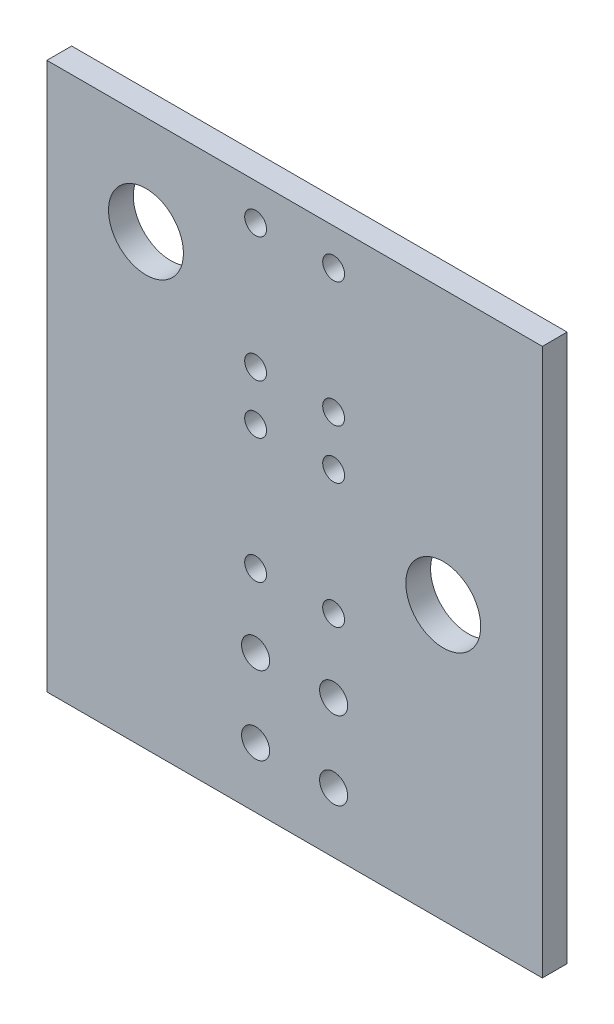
ISO-10303-21;
HEADER;
FILE_DESCRIPTION(('STEP AP214'),'2;1');
FILE_NAME('part.step','',(''),(''),'','','');
FILE_SCHEMA(('AUTOMOTIVE_DESIGN { 1 0 10303 214 1 1 1 1 }'));
ENDSEC;
DATA;
#1=APPLICATION_CONTEXT('core data for automotive mechanical design processes');
#2=APPLICATION_PROTOCOL_DEFINITION('international standard','automotive_design',2000,#1);
#3=PRODUCT_CONTEXT('',#1,'mechanical');
#4=PRODUCT('Part','Part','',(#3));
#5=PRODUCT_RELATED_PRODUCT_CATEGORY('part','',(#4));
#6=PRODUCT_DEFINITION_FORMATION('','',#4);
#7=PRODUCT_DEFINITION_CONTEXT('part definition',#1,'design');
#8=PRODUCT_DEFINITION('design','',#6,#7);
#9=PRODUCT_DEFINITION_SHAPE('','',#8);
#10=(LENGTH_UNIT() NAMED_UNIT(*) SI_UNIT(.MILLI.,.METRE.));
#11=(NAMED_UNIT(*) PLANE_ANGLE_UNIT() SI_UNIT($,.RADIAN.));
#12=(NAMED_UNIT(*) SI_UNIT($,.STERADIAN.) SOLID_ANGLE_UNIT());
#13=UNCERTAINTY_MEASURE_WITH_UNIT(LENGTH_MEASURE(1.E-05),#10,'distance_accuracy_value','');
#14=(GEOMETRIC_REPRESENTATION_CONTEXT(3) GLOBAL_UNCERTAINTY_ASSIGNED_CONTEXT((#13)) GLOBAL_UNIT_ASSIGNED_CONTEXT((#10,
#11,#12)) REPRESENTATION_CONTEXT('',''));
#15=CARTESIAN_POINT('',(0.,0.,0.));
#16=DIRECTION('',(0.,0.,1.));
#17=DIRECTION('',(1.,0.,0.));
#18=AXIS2_PLACEMENT_3D('',#15,#16,#17);
#19=CARTESIAN_POINT('',(-7.9375,0.,0.79375));
#20=DIRECTION('',(1.,0.,0.));
#21=DIRECTION('',(0.,1.,0.));
#22=AXIS2_PLACEMENT_3D('',#19,#20,#21);
#23=PLANE('',#22);
#24=DIRECTION('',(0.,-1.,0.));
#25=VECTOR('',#24,1.);
#26=CARTESIAN_POINT('',(-7.9375,0.,0.));
#27=LINE('',#26,#25);
#28=CARTESIAN_POINT('',(-7.9375,0.,0.));
#29=VERTEX_POINT('',#28);
#30=CARTESIAN_POINT('',(-7.9375,-17.526,0.));
#31=VERTEX_POINT('',#30);
#32=EDGE_CURVE('E108',#29,#31,#27,.T.);
#33=ORIENTED_EDGE('',*,*,#32,.T.);
#34=DIRECTION('',(0.,0.,-1.));
#35=VECTOR('',#34,1.);
#36=CARTESIAN_POINT('',(-7.9375,-17.526,0.79375));
#37=LINE('',#36,#35);
#38=CARTESIAN_POINT('',(-7.9375,-17.526,0.79375));
#39=VERTEX_POINT('',#38);
#40=EDGE_CURVE('E11',#39,#31,#37,.T.);
#41=ORIENTED_EDGE('',*,*,#40,.F.);
#42=DIRECTION('',(0.,-1.,0.));
#43=VECTOR('',#42,1.);
#44=CARTESIAN_POINT('',(-7.9375,0.,0.79375));
#45=LINE('',#44,#43);
#46=CARTESIAN_POINT('',(-7.9375,0.,0.79375));
#47=VERTEX_POINT('',#46);
#48=EDGE_CURVE('E96',#47,#39,#45,.T.);
#49=ORIENTED_EDGE('',*,*,#48,.F.);
#50=DIRECTION('',(0.,0.,-1.));
#51=VECTOR('',#50,1.);
#52=CARTESIAN_POINT('',(-7.9375,0.,0.79375));
#53=LINE('',#52,#51);
#54=EDGE_CURVE('E104',#47,#29,#53,.T.);
#55=ORIENTED_EDGE('',*,*,#54,.T.);
#56=EDGE_LOOP('',(#33,#41,#49,#55));
#57=FACE_BOUND('',#56,.T.);
#58=ADVANCED_FACE('F45',(#57),#23,.F.);
#59=CARTESIAN_POINT('',(-7.9375,-17.526,0.79375));
#60=DIRECTION('',(0.,1.,0.));
#61=DIRECTION('',(-1.,0.,0.));
#62=AXIS2_PLACEMENT_3D('',#59,#60,#61);
#63=PLANE('',#62);
#64=DIRECTION('',(1.,0.,0.));
#65=VECTOR('',#64,1.);
#66=CARTESIAN_POINT('',(-7.9375,-17.526,0.));
#67=LINE('',#66,#65);
#68=CARTESIAN_POINT('',(7.9375,-17.526,0.));
#69=VERTEX_POINT('',#68);
#70=EDGE_CURVE('E100',#31,#69,#67,.T.);
#71=ORIENTED_EDGE('',*,*,#70,.T.);
#72=DIRECTION('',(0.,0.,-1.));
#73=VECTOR('',#72,1.);
#74=CARTESIAN_POINT('',(7.9375,-17.526,0.79375));
#75=LINE('',#74,#73);
#76=CARTESIAN_POINT('',(7.9375,-17.526,0.79375));
#77=VERTEX_POINT('',#76);
#78=EDGE_CURVE('E53',#77,#69,#75,.T.);
#79=ORIENTED_EDGE('',*,*,#78,.F.);
#80=DIRECTION('',(1.,0.,0.));
#81=VECTOR('',#80,1.);
#82=CARTESIAN_POINT('',(-7.9375,-17.526,0.79375));
#83=LINE('',#82,#81);
#84=EDGE_CURVE('E91',#39,#77,#83,.T.);
#85=ORIENTED_EDGE('',*,*,#84,.F.);
#86=ORIENTED_EDGE('',*,*,#40,.T.);
#87=EDGE_LOOP('',(#71,#79,#85,#86));
#88=FACE_BOUND('',#87,.T.);
#89=ADVANCED_FACE('F99',(#88),#63,.F.);
#90=CARTESIAN_POINT('',(7.9375,0.,0.79375));
#91=DIRECTION('',(-1.,0.,0.));
#92=DIRECTION('',(0.,-1.,0.));
#93=AXIS2_PLACEMENT_3D('',#90,#91,#92);
#94=PLANE('',#93);
#95=DIRECTION('',(0.,1.,0.));
#96=VECTOR('',#95,1.);
#97=CARTESIAN_POINT('',(7.9375,0.,0.));
#98=LINE('',#97,#96);
#99=CARTESIAN_POINT('',(7.9375,0.,0.));
#100=VERTEX_POINT('',#99);
#101=EDGE_CURVE('E78',#69,#100,#98,.T.);
#102=ORIENTED_EDGE('',*,*,#101,.T.);
#103=DIRECTION('',(0.,0.,-1.));
#104=VECTOR('',#103,1.);
#105=CARTESIAN_POINT('',(7.9375,0.,0.79375));
#106=LINE('',#105,#104);
#107=CARTESIAN_POINT('',(7.9375,0.,0.79375));
#108=VERTEX_POINT('',#107);
#109=EDGE_CURVE('E101',#108,#100,#106,.T.);
#110=ORIENTED_EDGE('',*,*,#109,.F.);
#111=DIRECTION('',(0.,1.,0.));
#112=VECTOR('',#111,1.);
#113=CARTESIAN_POINT('',(7.9375,0.,0.79375));
#114=LINE('',#113,#112);
#115=EDGE_CURVE('E94',#77,#108,#114,.T.);
#116=ORIENTED_EDGE('',*,*,#115,.F.);
#117=ORIENTED_EDGE('',*,*,#78,.T.);
#118=EDGE_LOOP('',(#102,#110,#116,#117));
#119=FACE_BOUND('',#118,.T.);
#120=ADVANCED_FACE('F102',(#119),#94,.F.);
#121=CARTESIAN_POINT('',(-7.9375,0.,0.79375));
#122=DIRECTION('',(0.,-1.,0.));
#123=DIRECTION('',(1.,0.,0.));
#124=AXIS2_PLACEMENT_3D('',#121,#122,#123);
#125=PLANE('',#124);
#126=DIRECTION('',(-1.,0.,0.));
#127=VECTOR('',#126,1.);
#128=CARTESIAN_POINT('',(-7.9375,0.,0.));
#129=LINE('',#128,#127);
#130=EDGE_CURVE('E84',#100,#29,#129,.T.);
#131=ORIENTED_EDGE('',*,*,#130,.T.);
#132=ORIENTED_EDGE('',*,*,#54,.F.);
#133=DIRECTION('',(-1.,0.,0.));
#134=VECTOR('',#133,1.);
#135=CARTESIAN_POINT('',(-7.9375,0.,0.79375));
#136=LINE('',#135,#134);
#137=EDGE_CURVE('E61',#108,#47,#136,.T.);
#138=ORIENTED_EDGE('',*,*,#137,.F.);
#139=ORIENTED_EDGE('',*,*,#109,.T.);
#140=EDGE_LOOP('',(#131,#132,#138,#139));
#141=FACE_BOUND('',#140,.T.);
#142=ADVANCED_FACE('F116',(#141),#125,.F.);
#143=CARTESIAN_POINT('',(0.,0.,0.79375));
#144=DIRECTION('',(0.,0.,1.));
#145=DIRECTION('',(1.,0.,0.));
#146=AXIS2_PLACEMENT_3D('',#143,#144,#145);
#147=PLANE('',#146);
#148=CARTESIAN_POINT('',(-1.25,-13.0944,0.793750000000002));
#149=DIRECTION('',(0.,0.,1.));
#150=DIRECTION('',(1.,0.,0.));
#151=AXIS2_PLACEMENT_3D('',#148,#149,#150);
#152=CIRCLE('',#151,0.449999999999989);
#153=CARTESIAN_POINT('',(-0.800000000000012,-13.0944,0.793750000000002));
#154=VERTEX_POINT('',#153);
#155=EDGE_CURVE('E202',#154,#154,#152,.T.);
#156=ORIENTED_EDGE('',*,*,#155,.F.);
#157=EDGE_LOOP('',(#156));
#158=FACE_BOUND('',#157,.T.);
#159=CARTESIAN_POINT('',(1.25,-13.0944,0.793750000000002));
#160=DIRECTION('',(0.,0.,1.));
#161=DIRECTION('',(1.,0.,0.));
#162=AXIS2_PLACEMENT_3D('',#159,#160,#161);
#163=CIRCLE('',#162,0.449999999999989);
#164=CARTESIAN_POINT('',(1.69999999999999,-13.0944,0.793750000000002));
#165=VERTEX_POINT('',#164);
#166=EDGE_CURVE('E196',#165,#165,#163,.T.);
#167=ORIENTED_EDGE('',*,*,#166,.F.);
#168=EDGE_LOOP('',(#167));
#169=FACE_BOUND('',#168,.T.);
#170=CARTESIAN_POINT('',(1.25,-15.5944,0.793750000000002));
#171=DIRECTION('',(0.,0.,1.));
#172=DIRECTION('',(1.,0.,0.));
#173=AXIS2_PLACEMENT_3D('',#170,#171,#172);
#174=CIRCLE('',#173,0.449999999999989);
#175=CARTESIAN_POINT('',(1.69999999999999,-15.5944,0.793750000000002));
#176=VERTEX_POINT('',#175);
#177=EDGE_CURVE('E190',#176,#176,#174,.T.);
#178=ORIENTED_EDGE('',*,*,#177,.F.);
#179=EDGE_LOOP('',(#178));
#180=FACE_BOUND('',#179,.T.);
#181=CARTESIAN_POINT('',(-1.25,-15.5944,0.793750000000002));
#182=DIRECTION('',(0.,0.,1.));
#183=DIRECTION('',(1.,0.,0.));
#184=AXIS2_PLACEMENT_3D('',#181,#182,#183);
#185=CIRCLE('',#184,0.449999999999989);
#186=CARTESIAN_POINT('',(-0.800000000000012,-15.5944,0.793750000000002));
#187=VERTEX_POINT('',#186);
#188=EDGE_CURVE('E184',#187,#187,#185,.T.);
#189=ORIENTED_EDGE('',*,*,#188,.F.);
#190=EDGE_LOOP('',(#189));
#191=FACE_BOUND('',#190,.T.);
#192=CARTESIAN_POINT('',(-4.7625,-3.1684,0.793750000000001));
#193=DIRECTION('',(0.,0.,1.));
#194=DIRECTION('',(1.,0.,0.));
#195=AXIS2_PLACEMENT_3D('',#192,#193,#194);
#196=CIRCLE('',#195,1.19999999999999);
#197=CARTESIAN_POINT('',(-3.56250000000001,-3.1684,0.793750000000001));
#198=VERTEX_POINT('',#197);
#199=EDGE_CURVE('E178',#198,#198,#196,.T.);
#200=ORIENTED_EDGE('',*,*,#199,.F.);
#201=EDGE_LOOP('',(#200));
#202=FACE_BOUND('',#201,.T.);
#203=CARTESIAN_POINT('',(4.7625,-8.7564,0.793750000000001));
#204=DIRECTION('',(0.,0.,1.));
#205=DIRECTION('',(1.,0.,0.));
#206=AXIS2_PLACEMENT_3D('',#203,#204,#205);
#207=CIRCLE('',#206,1.19999999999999);
#208=CARTESIAN_POINT('',(5.96249999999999,-8.7564,0.793750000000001));
#209=VERTEX_POINT('',#208);
#210=EDGE_CURVE('E172',#209,#209,#207,.T.);
#211=ORIENTED_EDGE('',*,*,#210,.F.);
#212=EDGE_LOOP('',(#211));
#213=FACE_BOUND('',#212,.T.);
#214=CARTESIAN_POINT('',(1.25,-6.7564,0.793750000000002));
#215=DIRECTION('',(0.,0.,1.));
#216=DIRECTION('',(1.,0.,0.));
#217=AXIS2_PLACEMENT_3D('',#214,#215,#216);
#218=CIRCLE('',#217,0.349999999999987);
#219=CARTESIAN_POINT('',(1.59999999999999,-6.7564,0.793750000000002));
#220=VERTEX_POINT('',#219);
#221=EDGE_CURVE('E163',#220,#220,#218,.T.);
#222=ORIENTED_EDGE('',*,*,#221,.F.);
#223=EDGE_LOOP('',(#222));
#224=FACE_BOUND('',#223,.T.);
#225=CARTESIAN_POINT('',(-1.25,-10.7564,0.793750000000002));
#226=DIRECTION('',(0.,0.,1.));
#227=DIRECTION('',(1.,0.,0.));
#228=AXIS2_PLACEMENT_3D('',#225,#226,#227);
#229=CIRCLE('',#228,0.349999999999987);
#230=CARTESIAN_POINT('',(-0.900000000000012,-10.7564,0.793750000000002));
#231=VERTEX_POINT('',#230);
#232=EDGE_CURVE('E157',#231,#231,#229,.T.);
#233=ORIENTED_EDGE('',*,*,#232,.F.);
#234=EDGE_LOOP('',(#233));
#235=FACE_BOUND('',#234,.T.);
#236=CARTESIAN_POINT('',(1.25,-10.7564,0.793750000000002));
#237=DIRECTION('',(0.,0.,1.));
#238=DIRECTION('',(1.,0.,0.));
#239=AXIS2_PLACEMENT_3D('',#236,#237,#238);
#240=CIRCLE('',#239,0.349999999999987);
#241=CARTESIAN_POINT('',(1.59999999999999,-10.7564,0.793750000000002));
#242=VERTEX_POINT('',#241);
#243=EDGE_CURVE('E151',#242,#242,#240,.T.);
#244=ORIENTED_EDGE('',*,*,#243,.F.);
#245=EDGE_LOOP('',(#244));
#246=FACE_BOUND('',#245,.T.);
#247=CARTESIAN_POINT('',(-1.25,-6.7564,0.793750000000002));
#248=DIRECTION('',(0.,0.,1.));
#249=DIRECTION('',(1.,0.,0.));
#250=AXIS2_PLACEMENT_3D('',#247,#248,#249);
#251=CIRCLE('',#250,0.349999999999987);
#252=CARTESIAN_POINT('',(-0.900000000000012,-6.7564,0.793750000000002));
#253=VERTEX_POINT('',#252);
#254=EDGE_CURVE('E145',#253,#253,#251,.T.);
#255=ORIENTED_EDGE('',*,*,#254,.F.);
#256=EDGE_LOOP('',(#255));
#257=FACE_BOUND('',#256,.T.);
#258=CARTESIAN_POINT('',(-1.25,-1.1684,0.793750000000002));
#259=DIRECTION('',(0.,0.,1.));
#260=DIRECTION('',(1.,0.,0.));
#261=AXIS2_PLACEMENT_3D('',#258,#259,#260);
#262=CIRCLE('',#261,0.349999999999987);
#263=CARTESIAN_POINT('',(-0.900000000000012,-1.1684,0.793750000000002));
#264=VERTEX_POINT('',#263);
#265=EDGE_CURVE('E142',#264,#264,#262,.T.);
#266=ORIENTED_EDGE('',*,*,#265,.F.);
#267=EDGE_LOOP('',(#266));
#268=FACE_BOUND('',#267,.T.);
#269=CARTESIAN_POINT('',(1.25,-1.1684,0.793750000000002));
#270=DIRECTION('',(0.,0.,1.));
#271=DIRECTION('',(1.,0.,0.));
#272=AXIS2_PLACEMENT_3D('',#269,#270,#271);
#273=CIRCLE('',#272,0.349999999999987);
#274=CARTESIAN_POINT('',(1.59999999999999,-1.1684,0.793750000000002));
#275=VERTEX_POINT('',#274);
#276=EDGE_CURVE('E136',#275,#275,#273,.T.);
#277=ORIENTED_EDGE('',*,*,#276,.F.);
#278=EDGE_LOOP('',(#277));
#279=FACE_BOUND('',#278,.T.);
#280=CARTESIAN_POINT('',(-1.25,-5.1684,0.793750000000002));
#281=DIRECTION('',(0.,0.,1.));
#282=DIRECTION('',(1.,0.,0.));
#283=AXIS2_PLACEMENT_3D('',#280,#281,#282);
#284=CIRCLE('',#283,0.349999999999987);
#285=CARTESIAN_POINT('',(-0.900000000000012,-5.1684,0.793750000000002));
#286=VERTEX_POINT('',#285);
#287=EDGE_CURVE('E130',#286,#286,#284,.T.);
#288=ORIENTED_EDGE('',*,*,#287,.F.);
#289=EDGE_LOOP('',(#288));
#290=FACE_BOUND('',#289,.T.);
#291=CARTESIAN_POINT('',(1.25,-5.1684,0.793750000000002));
#292=DIRECTION('',(0.,0.,1.));
#293=DIRECTION('',(1.,0.,0.));
#294=AXIS2_PLACEMENT_3D('',#291,#292,#293);
#295=CIRCLE('',#294,0.349999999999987);
#296=CARTESIAN_POINT('',(1.59999999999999,-5.1684,0.793750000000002));
#297=VERTEX_POINT('',#296);
#298=EDGE_CURVE('E124',#297,#297,#295,.T.);
#299=ORIENTED_EDGE('',*,*,#298,.F.);
#300=EDGE_LOOP('',(#299));
#301=FACE_BOUND('',#300,.T.);
#302=ORIENTED_EDGE('',*,*,#48,.T.);
#303=ORIENTED_EDGE('',*,*,#84,.T.);
#304=ORIENTED_EDGE('',*,*,#115,.T.);
#305=ORIENTED_EDGE('',*,*,#137,.T.);
#306=EDGE_LOOP('',(#302,#303,#304,#305));
#307=FACE_BOUND('',#306,.T.);
#308=ADVANCED_FACE('F92',(#158,#169,#180,#191,#202,#213,#224,#235,#246,#257,#268,#279,#290,#301,
#307),#147,.T.);
#309=CARTESIAN_POINT('',(0.,0.,0.));
#310=DIRECTION('',(0.,0.,1.));
#311=DIRECTION('',(1.,0.,0.));
#312=AXIS2_PLACEMENT_3D('',#309,#310,#311);
#313=PLANE('',#312);
#314=CARTESIAN_POINT('',(-1.25,-13.0944,0.));
#315=DIRECTION('',(0.,0.,1.));
#316=DIRECTION('',(1.,0.,0.));
#317=AXIS2_PLACEMENT_3D('',#314,#315,#316);
#318=CIRCLE('',#317,0.449999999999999);
#319=CARTESIAN_POINT('',(-0.800000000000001,-13.0944,0.));
#320=VERTEX_POINT('',#319);
#321=EDGE_CURVE('E199',#320,#320,#318,.T.);
#322=ORIENTED_EDGE('',*,*,#321,.T.);
#323=EDGE_LOOP('',(#322));
#324=FACE_BOUND('',#323,.T.);
#325=CARTESIAN_POINT('',(1.25,-13.0944,0.));
#326=DIRECTION('',(0.,0.,1.));
#327=DIRECTION('',(1.,0.,0.));
#328=AXIS2_PLACEMENT_3D('',#325,#326,#327);
#329=CIRCLE('',#328,0.449999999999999);
#330=CARTESIAN_POINT('',(1.7,-13.0944,0.));
#331=VERTEX_POINT('',#330);
#332=EDGE_CURVE('E193',#331,#331,#329,.T.);
#333=ORIENTED_EDGE('',*,*,#332,.T.);
#334=EDGE_LOOP('',(#333));
#335=FACE_BOUND('',#334,.T.);
#336=CARTESIAN_POINT('',(1.25,-15.5944,0.));
#337=DIRECTION('',(0.,0.,1.));
#338=DIRECTION('',(1.,0.,0.));
#339=AXIS2_PLACEMENT_3D('',#336,#337,#338);
#340=CIRCLE('',#339,0.449999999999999);
#341=CARTESIAN_POINT('',(1.7,-15.5944,0.));
#342=VERTEX_POINT('',#341);
#343=EDGE_CURVE('E187',#342,#342,#340,.T.);
#344=ORIENTED_EDGE('',*,*,#343,.T.);
#345=EDGE_LOOP('',(#344));
#346=FACE_BOUND('',#345,.T.);
#347=CARTESIAN_POINT('',(-1.25,-15.5944,0.));
#348=DIRECTION('',(0.,0.,1.));
#349=DIRECTION('',(1.,0.,0.));
#350=AXIS2_PLACEMENT_3D('',#347,#348,#349);
#351=CIRCLE('',#350,0.449999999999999);
#352=CARTESIAN_POINT('',(-0.800000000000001,-15.5944,0.));
#353=VERTEX_POINT('',#352);
#354=EDGE_CURVE('E181',#353,#353,#351,.T.);
#355=ORIENTED_EDGE('',*,*,#354,.T.);
#356=EDGE_LOOP('',(#355));
#357=FACE_BOUND('',#356,.T.);
#358=CARTESIAN_POINT('',(-4.7625,-3.1684,0.));
#359=DIRECTION('',(0.,0.,1.));
#360=DIRECTION('',(1.,0.,0.));
#361=AXIS2_PLACEMENT_3D('',#358,#359,#360);
#362=CIRCLE('',#361,1.2);
#363=CARTESIAN_POINT('',(-3.5625,-3.1684,0.));
#364=VERTEX_POINT('',#363);
#365=EDGE_CURVE('E175',#364,#364,#362,.T.);
#366=ORIENTED_EDGE('',*,*,#365,.T.);
#367=EDGE_LOOP('',(#366));
#368=FACE_BOUND('',#367,.T.);
#369=CARTESIAN_POINT('',(4.7625,-8.7564,0.));
#370=DIRECTION('',(0.,0.,1.));
#371=DIRECTION('',(1.,0.,0.));
#372=AXIS2_PLACEMENT_3D('',#369,#370,#371);
#373=CIRCLE('',#372,1.2);
#374=CARTESIAN_POINT('',(5.9625,-8.7564,0.));
#375=VERTEX_POINT('',#374);
#376=EDGE_CURVE('E169',#375,#375,#373,.T.);
#377=ORIENTED_EDGE('',*,*,#376,.T.);
#378=EDGE_LOOP('',(#377));
#379=FACE_BOUND('',#378,.T.);
#380=CARTESIAN_POINT('',(1.25,-6.7564,0.));
#381=DIRECTION('',(0.,0.,1.));
#382=DIRECTION('',(1.,0.,0.));
#383=AXIS2_PLACEMENT_3D('',#380,#381,#382);
#384=CIRCLE('',#383,0.349999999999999);
#385=CARTESIAN_POINT('',(1.6,-6.7564,0.));
#386=VERTEX_POINT('',#385);
#387=EDGE_CURVE('E166',#386,#386,#384,.T.);
#388=ORIENTED_EDGE('',*,*,#387,.T.);
#389=EDGE_LOOP('',(#388));
#390=FACE_BOUND('',#389,.T.);
#391=CARTESIAN_POINT('',(-1.25,-10.7564,0.));
#392=DIRECTION('',(0.,0.,1.));
#393=DIRECTION('',(1.,0.,0.));
#394=AXIS2_PLACEMENT_3D('',#391,#392,#393);
#395=CIRCLE('',#394,0.349999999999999);
#396=CARTESIAN_POINT('',(-0.9,-10.7564,0.));
#397=VERTEX_POINT('',#396);
#398=EDGE_CURVE('E160',#397,#397,#395,.T.);
#399=ORIENTED_EDGE('',*,*,#398,.T.);
#400=EDGE_LOOP('',(#399));
#401=FACE_BOUND('',#400,.T.);
#402=CARTESIAN_POINT('',(1.25,-10.7564,0.));
#403=DIRECTION('',(0.,0.,1.));
#404=DIRECTION('',(1.,0.,0.));
#405=AXIS2_PLACEMENT_3D('',#402,#403,#404);
#406=CIRCLE('',#405,0.349999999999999);
#407=CARTESIAN_POINT('',(1.6,-10.7564,0.));
#408=VERTEX_POINT('',#407);
#409=EDGE_CURVE('E154',#408,#408,#406,.T.);
#410=ORIENTED_EDGE('',*,*,#409,.T.);
#411=EDGE_LOOP('',(#410));
#412=FACE_BOUND('',#411,.T.);
#413=CARTESIAN_POINT('',(-1.25,-6.7564,0.));
#414=DIRECTION('',(0.,0.,1.));
#415=DIRECTION('',(1.,0.,0.));
#416=AXIS2_PLACEMENT_3D('',#413,#414,#415);
#417=CIRCLE('',#416,0.349999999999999);
#418=CARTESIAN_POINT('',(-0.9,-6.7564,0.));
#419=VERTEX_POINT('',#418);
#420=EDGE_CURVE('E148',#419,#419,#417,.T.);
#421=ORIENTED_EDGE('',*,*,#420,.T.);
#422=EDGE_LOOP('',(#421));
#423=FACE_BOUND('',#422,.T.);
#424=CARTESIAN_POINT('',(-1.25,-1.1684,0.));
#425=DIRECTION('',(0.,0.,1.));
#426=DIRECTION('',(1.,0.,0.));
#427=AXIS2_PLACEMENT_3D('',#424,#425,#426);
#428=CIRCLE('',#427,0.349999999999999);
#429=CARTESIAN_POINT('',(-0.9,-1.1684,0.));
#430=VERTEX_POINT('',#429);
#431=EDGE_CURVE('E139',#430,#430,#428,.T.);
#432=ORIENTED_EDGE('',*,*,#431,.T.);
#433=EDGE_LOOP('',(#432));
#434=FACE_BOUND('',#433,.T.);
#435=CARTESIAN_POINT('',(1.25,-1.1684,0.));
#436=DIRECTION('',(0.,0.,1.));
#437=DIRECTION('',(1.,0.,0.));
#438=AXIS2_PLACEMENT_3D('',#435,#436,#437);
#439=CIRCLE('',#438,0.349999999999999);
#440=CARTESIAN_POINT('',(1.6,-1.1684,0.));
#441=VERTEX_POINT('',#440);
#442=EDGE_CURVE('E133',#441,#441,#439,.T.);
#443=ORIENTED_EDGE('',*,*,#442,.T.);
#444=EDGE_LOOP('',(#443));
#445=FACE_BOUND('',#444,.T.);
#446=CARTESIAN_POINT('',(-1.25,-5.1684,0.));
#447=DIRECTION('',(0.,0.,1.));
#448=DIRECTION('',(1.,0.,0.));
#449=AXIS2_PLACEMENT_3D('',#446,#447,#448);
#450=CIRCLE('',#449,0.349999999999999);
#451=CARTESIAN_POINT('',(-0.9,-5.1684,0.));
#452=VERTEX_POINT('',#451);
#453=EDGE_CURVE('E127',#452,#452,#450,.T.);
#454=ORIENTED_EDGE('',*,*,#453,.T.);
#455=EDGE_LOOP('',(#454));
#456=FACE_BOUND('',#455,.T.);
#457=CARTESIAN_POINT('',(1.25,-5.1684,0.));
#458=DIRECTION('',(0.,0.,1.));
#459=DIRECTION('',(1.,0.,0.));
#460=AXIS2_PLACEMENT_3D('',#457,#458,#459);
#461=CIRCLE('',#460,0.349999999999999);
#462=CARTESIAN_POINT('',(1.6,-5.1684,0.));
#463=VERTEX_POINT('',#462);
#464=EDGE_CURVE('E111',#463,#463,#461,.T.);
#465=ORIENTED_EDGE('',*,*,#464,.T.);
#466=EDGE_LOOP('',(#465));
#467=FACE_BOUND('',#466,.T.);
#468=ORIENTED_EDGE('',*,*,#32,.F.);
#469=ORIENTED_EDGE('',*,*,#130,.F.);
#470=ORIENTED_EDGE('',*,*,#101,.F.);
#471=ORIENTED_EDGE('',*,*,#70,.F.);
#472=EDGE_LOOP('',(#468,#469,#470,#471));
#473=FACE_BOUND('',#472,.T.);
#474=ADVANCED_FACE('F119',(#324,#335,#346,#357,#368,#379,#390,#401,#412,#423,#434,#445,#456,
#467,#473),#313,.F.);
#475=CARTESIAN_POINT('',(1.25,-5.1684,0.79375));
#476=DIRECTION('',(0.,0.,1.));
#477=DIRECTION('',(1.,0.,0.));
#478=AXIS2_PLACEMENT_3D('',#475,#476,#477);
#479=CYLINDRICAL_SURFACE('',#478,0.349999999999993);
#480=ORIENTED_EDGE('',*,*,#464,.F.);
#481=EDGE_LOOP('',(#480));
#482=FACE_BOUND('',#481,.T.);
#483=ORIENTED_EDGE('',*,*,#298,.T.);
#484=EDGE_LOOP('',(#483));
#485=FACE_BOUND('',#484,.T.);
#486=ADVANCED_FACE('F237',(#482,#485),#479,.F.);
#487=CARTESIAN_POINT('',(-1.25,-5.1684,0.79375));
#488=DIRECTION('',(0.,0.,1.));
#489=DIRECTION('',(1.,0.,0.));
#490=AXIS2_PLACEMENT_3D('',#487,#488,#489);
#491=CYLINDRICAL_SURFACE('',#490,0.349999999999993);
#492=ORIENTED_EDGE('',*,*,#453,.F.);
#493=EDGE_LOOP('',(#492));
#494=FACE_BOUND('',#493,.T.);
#495=ORIENTED_EDGE('',*,*,#287,.T.);
#496=EDGE_LOOP('',(#495));
#497=FACE_BOUND('',#496,.T.);
#498=ADVANCED_FACE('F239',(#494,#497),#491,.F.);
#499=CARTESIAN_POINT('',(1.25,-1.1684,0.79375));
#500=DIRECTION('',(0.,0.,1.));
#501=DIRECTION('',(1.,0.,0.));
#502=AXIS2_PLACEMENT_3D('',#499,#500,#501);
#503=CYLINDRICAL_SURFACE('',#502,0.349999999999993);
#504=ORIENTED_EDGE('',*,*,#442,.F.);
#505=EDGE_LOOP('',(#504));
#506=FACE_BOUND('',#505,.T.);
#507=ORIENTED_EDGE('',*,*,#276,.T.);
#508=EDGE_LOOP('',(#507));
#509=FACE_BOUND('',#508,.T.);
#510=ADVANCED_FACE('F246',(#506,#509),#503,.F.);
#511=CARTESIAN_POINT('',(-1.25,-1.1684,0.79375));
#512=DIRECTION('',(0.,0.,1.));
#513=DIRECTION('',(1.,0.,0.));
#514=AXIS2_PLACEMENT_3D('',#511,#512,#513);
#515=CYLINDRICAL_SURFACE('',#514,0.349999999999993);
#516=ORIENTED_EDGE('',*,*,#431,.F.);
#517=EDGE_LOOP('',(#516));
#518=FACE_BOUND('',#517,.T.);
#519=ORIENTED_EDGE('',*,*,#265,.T.);
#520=EDGE_LOOP('',(#519));
#521=FACE_BOUND('',#520,.T.);
#522=ADVANCED_FACE('F383',(#518,#521),#515,.F.);
#523=CARTESIAN_POINT('',(-1.25,-6.7564,0.79375));
#524=DIRECTION('',(0.,0.,1.));
#525=DIRECTION('',(1.,0.,0.));
#526=AXIS2_PLACEMENT_3D('',#523,#524,#525);
#527=CYLINDRICAL_SURFACE('',#526,0.349999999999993);
#528=ORIENTED_EDGE('',*,*,#420,.F.);
#529=EDGE_LOOP('',(#528));
#530=FACE_BOUND('',#529,.T.);
#531=ORIENTED_EDGE('',*,*,#254,.T.);
#532=EDGE_LOOP('',(#531));
#533=FACE_BOUND('',#532,.T.);
#534=ADVANCED_FACE('F373',(#530,#533),#527,.F.);
#535=CARTESIAN_POINT('',(1.25,-10.7564,0.79375));
#536=DIRECTION('',(0.,0.,1.));
#537=DIRECTION('',(1.,0.,0.));
#538=AXIS2_PLACEMENT_3D('',#535,#536,#537);
#539=CYLINDRICAL_SURFACE('',#538,0.349999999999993);
#540=ORIENTED_EDGE('',*,*,#409,.F.);
#541=EDGE_LOOP('',(#540));
#542=FACE_BOUND('',#541,.T.);
#543=ORIENTED_EDGE('',*,*,#243,.T.);
#544=EDGE_LOOP('',(#543));
#545=FACE_BOUND('',#544,.T.);
#546=ADVANCED_FACE('F363',(#542,#545),#539,.F.);
#547=CARTESIAN_POINT('',(-1.25,-10.7564,0.79375));
#548=DIRECTION('',(0.,0.,1.));
#549=DIRECTION('',(1.,0.,0.));
#550=AXIS2_PLACEMENT_3D('',#547,#548,#549);
#551=CYLINDRICAL_SURFACE('',#550,0.349999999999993);
#552=ORIENTED_EDGE('',*,*,#398,.F.);
#553=EDGE_LOOP('',(#552));
#554=FACE_BOUND('',#553,.T.);
#555=ORIENTED_EDGE('',*,*,#232,.T.);
#556=EDGE_LOOP('',(#555));
#557=FACE_BOUND('',#556,.T.);
#558=ADVANCED_FACE('F353',(#554,#557),#551,.F.);
#559=CARTESIAN_POINT('',(1.25,-6.7564,0.79375));
#560=DIRECTION('',(0.,0.,1.));
#561=DIRECTION('',(1.,0.,0.));
#562=AXIS2_PLACEMENT_3D('',#559,#560,#561);
#563=CYLINDRICAL_SURFACE('',#562,0.349999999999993);
#564=ORIENTED_EDGE('',*,*,#387,.F.);
#565=EDGE_LOOP('',(#564));
#566=FACE_BOUND('',#565,.T.);
#567=ORIENTED_EDGE('',*,*,#221,.T.);
#568=EDGE_LOOP('',(#567));
#569=FACE_BOUND('',#568,.T.);
#570=ADVANCED_FACE('F343',(#566,#569),#563,.F.);
#571=CARTESIAN_POINT('',(4.7625,-8.7564,0.79375));
#572=DIRECTION('',(0.,0.,1.));
#573=DIRECTION('',(1.,0.,0.));
#574=AXIS2_PLACEMENT_3D('',#571,#572,#573);
#575=CYLINDRICAL_SURFACE('',#574,1.19999999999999);
#576=ORIENTED_EDGE('',*,*,#376,.F.);
#577=EDGE_LOOP('',(#576));
#578=FACE_BOUND('',#577,.T.);
#579=ORIENTED_EDGE('',*,*,#210,.T.);
#580=EDGE_LOOP('',(#579));
#581=FACE_BOUND('',#580,.T.);
#582=ADVANCED_FACE('F334',(#578,#581),#575,.F.);
#583=CARTESIAN_POINT('',(-4.7625,-3.1684,0.79375));
#584=DIRECTION('',(0.,0.,1.));
#585=DIRECTION('',(1.,0.,0.));
#586=AXIS2_PLACEMENT_3D('',#583,#584,#585);
#587=CYLINDRICAL_SURFACE('',#586,1.19999999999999);
#588=ORIENTED_EDGE('',*,*,#365,.F.);
#589=EDGE_LOOP('',(#588));
#590=FACE_BOUND('',#589,.T.);
#591=ORIENTED_EDGE('',*,*,#199,.T.);
#592=EDGE_LOOP('',(#591));
#593=FACE_BOUND('',#592,.T.);
#594=ADVANCED_FACE('F288',(#590,#593),#587,.F.);
#595=CARTESIAN_POINT('',(-1.25,-15.5944,0.79375));
#596=DIRECTION('',(0.,0.,1.));
#597=DIRECTION('',(1.,0.,0.));
#598=AXIS2_PLACEMENT_3D('',#595,#596,#597);
#599=CYLINDRICAL_SURFACE('',#598,0.449999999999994);
#600=ORIENTED_EDGE('',*,*,#354,.F.);
#601=EDGE_LOOP('',(#600));
#602=FACE_BOUND('',#601,.T.);
#603=ORIENTED_EDGE('',*,*,#188,.T.);
#604=EDGE_LOOP('',(#603));
#605=FACE_BOUND('',#604,.T.);
#606=ADVANCED_FACE('F282',(#602,#605),#599,.F.);
#607=CARTESIAN_POINT('',(1.25,-15.5944,0.79375));
#608=DIRECTION('',(0.,0.,1.));
#609=DIRECTION('',(1.,0.,0.));
#610=AXIS2_PLACEMENT_3D('',#607,#608,#609);
#611=CYLINDRICAL_SURFACE('',#610,0.449999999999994);
#612=ORIENTED_EDGE('',*,*,#343,.F.);
#613=EDGE_LOOP('',(#612));
#614=FACE_BOUND('',#613,.T.);
#615=ORIENTED_EDGE('',*,*,#177,.T.);
#616=EDGE_LOOP('',(#615));
#617=FACE_BOUND('',#616,.T.);
#618=ADVANCED_FACE('F287',(#614,#617),#611,.F.);
#619=CARTESIAN_POINT('',(1.25,-13.0944,0.79375));
#620=DIRECTION('',(0.,0.,1.));
#621=DIRECTION('',(1.,0.,0.));
#622=AXIS2_PLACEMENT_3D('',#619,#620,#621);
#623=CYLINDRICAL_SURFACE('',#622,0.449999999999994);
#624=ORIENTED_EDGE('',*,*,#332,.F.);
#625=EDGE_LOOP('',(#624));
#626=FACE_BOUND('',#625,.T.);
#627=ORIENTED_EDGE('',*,*,#166,.T.);
#628=EDGE_LOOP('',(#627));
#629=FACE_BOUND('',#628,.T.);
#630=ADVANCED_FACE('F301',(#626,#629),#623,.F.);
#631=CARTESIAN_POINT('',(-1.25,-13.0944,0.79375));
#632=DIRECTION('',(0.,0.,1.));
#633=DIRECTION('',(1.,0.,0.));
#634=AXIS2_PLACEMENT_3D('',#631,#632,#633);
#635=CYLINDRICAL_SURFACE('',#634,0.449999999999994);
#636=ORIENTED_EDGE('',*,*,#321,.F.);
#637=EDGE_LOOP('',(#636));
#638=FACE_BOUND('',#637,.T.);
#639=ORIENTED_EDGE('',*,*,#155,.T.);
#640=EDGE_LOOP('',(#639));
#641=FACE_BOUND('',#640,.T.);
#642=ADVANCED_FACE('F206',(#638,#641),#635,.F.);
#643=CLOSED_SHELL('',(#58,#89,#120,#142,#308,#474,#486,#498,#510,#522,#534,#546,#558,#570,#582,
#594,#606,#618,#630,#642));
#644=MANIFOLD_SOLID_BREP('B2',#643);
#645=ADVANCED_BREP_SHAPE_REPRESENTATION('',(#18,#644),#14);
#646=SHAPE_DEFINITION_REPRESENTATION(#9,#645);
ENDSEC;
END-ISO-10303-21;
